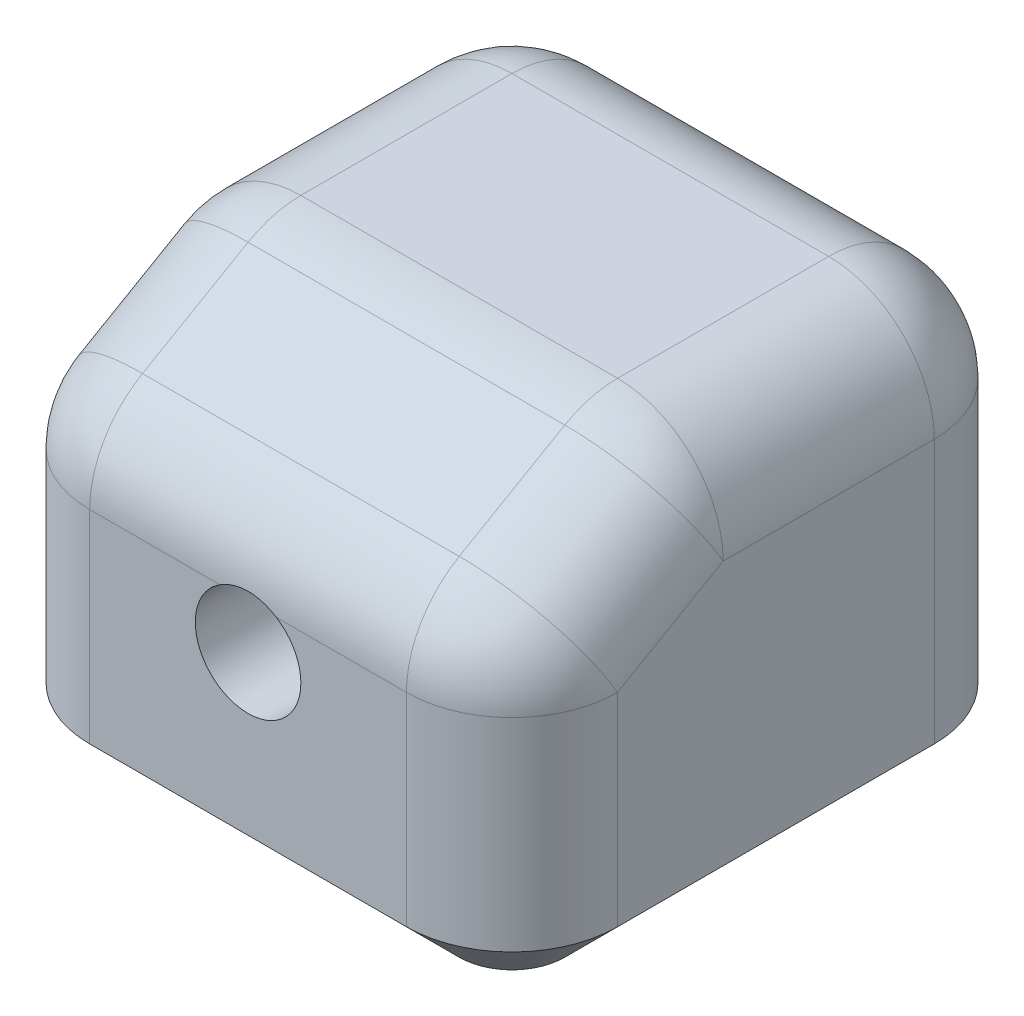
ISO-10303-21;
HEADER;
FILE_DESCRIPTION(('STEP AP214'),'2;1');
FILE_NAME('part.step','',(''),(''),'','','');
FILE_SCHEMA(('AUTOMOTIVE_DESIGN { 1 0 10303 214 1 1 1 1 }'));
ENDSEC;
DATA;
#1=APPLICATION_CONTEXT('core data for automotive mechanical design processes');
#2=APPLICATION_PROTOCOL_DEFINITION('international standard','automotive_design',2000,#1);
#3=PRODUCT_CONTEXT('',#1,'mechanical');
#4=PRODUCT('Part','Part','',(#3));
#5=PRODUCT_RELATED_PRODUCT_CATEGORY('part','',(#4));
#6=PRODUCT_DEFINITION_FORMATION('','',#4);
#7=PRODUCT_DEFINITION_CONTEXT('part definition',#1,'design');
#8=PRODUCT_DEFINITION('design','',#6,#7);
#9=PRODUCT_DEFINITION_SHAPE('','',#8);
#10=(LENGTH_UNIT() NAMED_UNIT(*) SI_UNIT(.MILLI.,.METRE.));
#11=(NAMED_UNIT(*) PLANE_ANGLE_UNIT() SI_UNIT($,.RADIAN.));
#12=(NAMED_UNIT(*) SI_UNIT($,.STERADIAN.) SOLID_ANGLE_UNIT());
#13=UNCERTAINTY_MEASURE_WITH_UNIT(LENGTH_MEASURE(1.E-05),#10,'distance_accuracy_value','');
#14=(GEOMETRIC_REPRESENTATION_CONTEXT(3) GLOBAL_UNCERTAINTY_ASSIGNED_CONTEXT((#13)) GLOBAL_UNIT_ASSIGNED_CONTEXT((#10,
#11,#12)) REPRESENTATION_CONTEXT('',''));
#15=CARTESIAN_POINT('',(0.,0.,0.));
#16=DIRECTION('',(0.,0.,1.));
#17=DIRECTION('',(1.,0.,0.));
#18=AXIS2_PLACEMENT_3D('',#15,#16,#17);
#19=CARTESIAN_POINT('',(-19.4081435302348,40.,-33.7655151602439));
#20=DIRECTION('',(1.,0.,0.));
#21=DIRECTION('',(0.,0.,-1.));
#22=AXIS2_PLACEMENT_3D('',#19,#20,#21);
#23=PLANE('',#22);
#24=DIRECTION('',(0.,-1.,0.));
#25=VECTOR('',#24,1.);
#26=CARTESIAN_POINT('',(-19.4081435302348,40.,6.23448483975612));
#27=LINE('',#26,#25);
#28=CARTESIAN_POINT('',(-19.4081435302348,5.00000000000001,6.23448483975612));
#29=VERTEX_POINT('',#28);
#30=CARTESIAN_POINT('',(-19.4081435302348,24.2264973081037,6.23448483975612));
#31=VERTEX_POINT('',#30);
#32=EDGE_CURVE('E478',#29,#31,#27,.F.);
#33=ORIENTED_EDGE('',*,*,#32,.T.);
#34=DIRECTION('',(0.,0.500000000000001,-0.866025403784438));
#35=VECTOR('',#34,1.);
#36=CARTESIAN_POINT('',(-19.4081435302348,31.3397459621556,-6.08602323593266));
#37=LINE('',#36,#35);
#38=CARTESIAN_POINT('',(-19.4081435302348,30.,-3.76551516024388));
#39=VERTEX_POINT('',#38);
#40=EDGE_CURVE('E400',#31,#39,#37,.T.);
#41=ORIENTED_EDGE('',*,*,#40,.T.);
#42=DIRECTION('',(0.,0.,1.));
#43=VECTOR('',#42,1.);
#44=CARTESIAN_POINT('',(-19.4081435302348,30.,-23.7655151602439));
#45=LINE('',#44,#43);
#46=CARTESIAN_POINT('',(-19.4081435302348,30.,-23.7655151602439));
#47=VERTEX_POINT('',#46);
#48=EDGE_CURVE('E415',#39,#47,#45,.F.);
#49=ORIENTED_EDGE('',*,*,#48,.T.);
#50=DIRECTION('',(0.,-1.,0.));
#51=VECTOR('',#50,1.);
#52=CARTESIAN_POINT('',(-19.4081435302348,40.,-23.7655151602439));
#53=LINE('',#52,#51);
#54=CARTESIAN_POINT('',(-19.4081435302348,5.00000000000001,-23.7655151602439));
#55=VERTEX_POINT('',#54);
#56=EDGE_CURVE('E199',#47,#55,#53,.T.);
#57=ORIENTED_EDGE('',*,*,#56,.T.);
#58=DIRECTION('',(0.,0.,1.));
#59=VECTOR('',#58,1.);
#60=CARTESIAN_POINT('',(-19.4081435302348,5.00000000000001,-33.7655151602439));
#61=LINE('',#60,#59);
#62=EDGE_CURVE('E224',#55,#29,#61,.T.);
#63=ORIENTED_EDGE('',*,*,#62,.T.);
#64=EDGE_LOOP('',(#33,#41,#49,#57,#63));
#65=FACE_BOUND('',#64,.T.);
#66=ADVANCED_FACE('F32',(#65),#23,.F.);
#67=CARTESIAN_POINT('',(-19.4081435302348,40.,16.2344848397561));
#68=DIRECTION('',(0.,0.,-1.));
#69=DIRECTION('',(-1.,0.,0.));
#70=AXIS2_PLACEMENT_3D('',#67,#68,#69);
#71=PLANE('',#70);
#72=DIRECTION('',(0.,-1.,0.));
#73=VECTOR('',#72,1.);
#74=CARTESIAN_POINT('',(20.5918564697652,40.,16.2344848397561));
#75=LINE('',#74,#73);
#76=CARTESIAN_POINT('',(20.5918564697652,5.00000000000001,16.2344848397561));
#77=VERTEX_POINT('',#76);
#78=CARTESIAN_POINT('',(20.5918564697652,24.2264973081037,16.2344848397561));
#79=VERTEX_POINT('',#78);
#80=EDGE_CURVE('E190',#77,#79,#75,.F.);
#81=ORIENTED_EDGE('',*,*,#80,.T.);
#82=DIRECTION('',(-1.,0.,0.));
#83=VECTOR('',#82,1.);
#84=CARTESIAN_POINT('',(-9.40814353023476,24.2264973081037,16.2344848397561));
#85=LINE('',#84,#83);
#86=CARTESIAN_POINT('',(8.26332058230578,24.2264973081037,16.2344848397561));
#87=VERTEX_POINT('',#86);
#88=EDGE_CURVE('E260',#79,#87,#85,.T.);
#89=ORIENTED_EDGE('',*,*,#88,.T.);
#90=CARTESIAN_POINT('',(5.59185646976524,20.,16.2344848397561));
#91=DIRECTION('',(0.,0.,1.));
#92=DIRECTION('',(1.,0.,0.));
#93=AXIS2_PLACEMENT_3D('',#90,#91,#92);
#94=CIRCLE('',#93,5.);
#95=CARTESIAN_POINT('',(2.9203923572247,24.2264973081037,16.2344848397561));
#96=VERTEX_POINT('',#95);
#97=EDGE_CURVE('E254',#96,#87,#94,.T.);
#98=ORIENTED_EDGE('',*,*,#97,.F.);
#99=DIRECTION('',(-1.,0.,0.));
#100=VECTOR('',#99,1.);
#101=CARTESIAN_POINT('',(-9.40814353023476,24.2264973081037,16.2344848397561));
#102=LINE('',#101,#100);
#103=CARTESIAN_POINT('',(-9.40814353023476,24.2264973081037,16.2344848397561));
#104=VERTEX_POINT('',#103);
#105=EDGE_CURVE('E258',#96,#104,#102,.T.);
#106=ORIENTED_EDGE('',*,*,#105,.T.);
#107=DIRECTION('',(0.,-1.,0.));
#108=VECTOR('',#107,1.);
#109=CARTESIAN_POINT('',(-9.40814353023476,40.,16.2344848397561));
#110=LINE('',#109,#108);
#111=CARTESIAN_POINT('',(-9.40814353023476,5.00000000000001,16.2344848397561));
#112=VERTEX_POINT('',#111);
#113=EDGE_CURVE('E205',#104,#112,#110,.T.);
#114=ORIENTED_EDGE('',*,*,#113,.T.);
#115=DIRECTION('',(1.,0.,0.));
#116=VECTOR('',#115,1.);
#117=CARTESIAN_POINT('',(-19.4081435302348,5.00000000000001,16.2344848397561));
#118=LINE('',#117,#116);
#119=EDGE_CURVE('E234',#112,#77,#118,.T.);
#120=ORIENTED_EDGE('',*,*,#119,.T.);
#121=EDGE_LOOP('',(#81,#89,#98,#106,#114,#120));
#122=FACE_BOUND('',#121,.T.);
#123=ADVANCED_FACE('F292',(#122),#71,.F.);
#124=CARTESIAN_POINT('',(30.5918564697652,40.,-33.7655151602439));
#125=DIRECTION('',(-1.,0.,0.));
#126=DIRECTION('',(0.,0.,1.));
#127=AXIS2_PLACEMENT_3D('',#124,#125,#126);
#128=PLANE('',#127);
#129=DIRECTION('',(0.,0.,-1.));
#130=VECTOR('',#129,1.);
#131=CARTESIAN_POINT('',(30.5918564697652,30.,-1.08602323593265));
#132=LINE('',#131,#130);
#133=CARTESIAN_POINT('',(30.5918564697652,30.,-23.7655151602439));
#134=VERTEX_POINT('',#133);
#135=CARTESIAN_POINT('',(30.5918564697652,30.,-3.76551516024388));
#136=VERTEX_POINT('',#135);
#137=EDGE_CURVE('E422',#134,#136,#132,.F.);
#138=ORIENTED_EDGE('',*,*,#137,.T.);
#139=DIRECTION('',(0.,-0.500000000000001,0.866025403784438));
#140=VECTOR('',#139,1.);
#141=CARTESIAN_POINT('',(30.5918564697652,27.1132486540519,1.23448483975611));
#142=LINE('',#141,#140);
#143=CARTESIAN_POINT('',(30.5918564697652,24.2264973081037,6.23448483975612));
#144=VERTEX_POINT('',#143);
#145=EDGE_CURVE('E424',#136,#144,#142,.T.);
#146=ORIENTED_EDGE('',*,*,#145,.T.);
#147=DIRECTION('',(0.,-1.,0.));
#148=VECTOR('',#147,1.);
#149=CARTESIAN_POINT('',(30.5918564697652,40.,6.23448483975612));
#150=LINE('',#149,#148);
#151=CARTESIAN_POINT('',(30.5918564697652,5.00000000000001,6.23448483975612));
#152=VERTEX_POINT('',#151);
#153=EDGE_CURVE('E195',#144,#152,#150,.T.);
#154=ORIENTED_EDGE('',*,*,#153,.T.);
#155=DIRECTION('',(0.,0.,-1.));
#156=VECTOR('',#155,1.);
#157=CARTESIAN_POINT('',(30.5918564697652,5.00000000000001,-33.7655151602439));
#158=LINE('',#157,#156);
#159=CARTESIAN_POINT('',(30.5918564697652,5.00000000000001,-23.7655151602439));
#160=VERTEX_POINT('',#159);
#161=EDGE_CURVE('E226',#152,#160,#158,.T.);
#162=ORIENTED_EDGE('',*,*,#161,.T.);
#163=DIRECTION('',(0.,-1.,0.));
#164=VECTOR('',#163,1.);
#165=CARTESIAN_POINT('',(30.5918564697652,40.,-23.7655151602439));
#166=LINE('',#165,#164);
#167=EDGE_CURVE('E197',#160,#134,#166,.F.);
#168=ORIENTED_EDGE('',*,*,#167,.T.);
#169=EDGE_LOOP('',(#138,#146,#154,#162,#168));
#170=FACE_BOUND('',#169,.T.);
#171=ADVANCED_FACE('F289',(#170),#128,.F.);
#172=CARTESIAN_POINT('',(-19.4081435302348,40.,-33.7655151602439));
#173=DIRECTION('',(0.,0.,1.));
#174=DIRECTION('',(1.,0.,0.));
#175=AXIS2_PLACEMENT_3D('',#172,#173,#174);
#176=PLANE('',#175);
#177=DIRECTION('',(0.,-1.,0.));
#178=VECTOR('',#177,1.);
#179=CARTESIAN_POINT('',(-9.40814353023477,40.,-33.7655151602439));
#180=LINE('',#179,#178);
#181=CARTESIAN_POINT('',(-9.40814353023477,5.00000000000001,-33.7655151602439));
#182=VERTEX_POINT('',#181);
#183=CARTESIAN_POINT('',(-9.40814353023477,30.,-33.7655151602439));
#184=VERTEX_POINT('',#183);
#185=EDGE_CURVE('E184',#182,#184,#180,.F.);
#186=ORIENTED_EDGE('',*,*,#185,.T.);
#187=DIRECTION('',(-1.,0.,0.));
#188=VECTOR('',#187,1.);
#189=CARTESIAN_POINT('',(20.5918564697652,30.,-33.7655151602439));
#190=LINE('',#189,#188);
#191=CARTESIAN_POINT('',(20.5918564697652,30.,-33.7655151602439));
#192=VERTEX_POINT('',#191);
#193=EDGE_CURVE('E11',#184,#192,#190,.F.);
#194=ORIENTED_EDGE('',*,*,#193,.T.);
#195=DIRECTION('',(0.,-1.,0.));
#196=VECTOR('',#195,1.);
#197=CARTESIAN_POINT('',(20.5918564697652,40.,-33.7655151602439));
#198=LINE('',#197,#196);
#199=CARTESIAN_POINT('',(20.5918564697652,5.00000000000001,-33.7655151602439));
#200=VERTEX_POINT('',#199);
#201=EDGE_CURVE('E187',#192,#200,#198,.T.);
#202=ORIENTED_EDGE('',*,*,#201,.T.);
#203=DIRECTION('',(-1.,0.,0.));
#204=VECTOR('',#203,1.);
#205=CARTESIAN_POINT('',(-19.4081435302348,5.00000000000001,-33.7655151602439));
#206=LINE('',#205,#204);
#207=EDGE_CURVE('E162',#200,#182,#206,.T.);
#208=ORIENTED_EDGE('',*,*,#207,.T.);
#209=EDGE_LOOP('',(#186,#194,#202,#208));
#210=FACE_BOUND('',#209,.T.);
#211=ADVANCED_FACE('F183',(#210),#176,.F.);
#212=CARTESIAN_POINT('',(-19.4081435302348,40.,16.2344848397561));
#213=DIRECTION('',(0.,1.,0.));
#214=DIRECTION('',(0.,0.,1.));
#215=AXIS2_PLACEMENT_3D('',#212,#213,#214);
#216=PLANE('',#215);
#217=DIRECTION('',(1.,0.,0.));
#218=VECTOR('',#217,1.);
#219=CARTESIAN_POINT('',(-19.4081435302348,40.,-3.76551516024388));
#220=LINE('',#219,#218);
#221=CARTESIAN_POINT('',(-9.40814353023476,40.,-3.76551516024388));
#222=VERTEX_POINT('',#221);
#223=CARTESIAN_POINT('',(20.5918564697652,40.,-3.76551516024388));
#224=VERTEX_POINT('',#223);
#225=EDGE_CURVE('E432',#222,#224,#220,.T.);
#226=ORIENTED_EDGE('',*,*,#225,.T.);
#227=DIRECTION('',(0.,0.,-1.));
#228=VECTOR('',#227,1.);
#229=CARTESIAN_POINT('',(20.5918564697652,40.,-23.7655151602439));
#230=LINE('',#229,#228);
#231=CARTESIAN_POINT('',(20.5918564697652,40.,-23.7655151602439));
#232=VERTEX_POINT('',#231);
#233=EDGE_CURVE('E41',#224,#232,#230,.T.);
#234=ORIENTED_EDGE('',*,*,#233,.T.);
#235=DIRECTION('',(-1.,0.,0.));
#236=VECTOR('',#235,1.);
#237=CARTESIAN_POINT('',(-9.40814353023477,40.,-23.7655151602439));
#238=LINE('',#237,#236);
#239=CARTESIAN_POINT('',(-9.40814353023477,40.,-23.7655151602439));
#240=VERTEX_POINT('',#239);
#241=EDGE_CURVE('E430',#232,#240,#238,.T.);
#242=ORIENTED_EDGE('',*,*,#241,.T.);
#243=DIRECTION('',(0.,0.,1.));
#244=VECTOR('',#243,1.);
#245=CARTESIAN_POINT('',(-9.40814353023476,40.,-1.08602323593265));
#246=LINE('',#245,#244);
#247=EDGE_CURVE('E428',#240,#222,#246,.T.);
#248=ORIENTED_EDGE('',*,*,#247,.T.);
#249=EDGE_LOOP('',(#226,#234,#242,#248));
#250=FACE_BOUND('',#249,.T.);
#251=ADVANCED_FACE('F281',(#250),#216,.T.);
#252=CARTESIAN_POINT('',(-19.4081435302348,0.,16.2344848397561));
#253=DIRECTION('',(0.,1.,0.));
#254=DIRECTION('',(0.,0.,1.));
#255=AXIS2_PLACEMENT_3D('',#252,#253,#254);
#256=PLANE('',#255);
#257=CARTESIAN_POINT('',(-9.40814353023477,0.,-23.7655151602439));
#258=DIRECTION('',(0.,1.,0.));
#259=DIRECTION('',(0.,0.,1.));
#260=AXIS2_PLACEMENT_3D('',#257,#258,#259);
#261=CIRCLE('',#260,4.99999999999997);
#262=CARTESIAN_POINT('',(-14.4081435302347,0.,-23.7655151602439));
#263=VERTEX_POINT('',#262);
#264=CARTESIAN_POINT('',(-9.40814353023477,0.,-28.7655151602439));
#265=VERTEX_POINT('',#264);
#266=EDGE_CURVE('E220',#263,#265,#261,.F.);
#267=ORIENTED_EDGE('',*,*,#266,.T.);
#268=DIRECTION('',(1.,0.,0.));
#269=VECTOR('',#268,1.);
#270=CARTESIAN_POINT('',(-19.4081435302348,0.,-28.7655151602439));
#271=LINE('',#270,#269);
#272=CARTESIAN_POINT('',(20.5918564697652,0.,-28.7655151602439));
#273=VERTEX_POINT('',#272);
#274=EDGE_CURVE('E164',#265,#273,#271,.T.);
#275=ORIENTED_EDGE('',*,*,#274,.T.);
#276=CARTESIAN_POINT('',(20.5918564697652,0.,-23.7655151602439));
#277=DIRECTION('',(0.,1.,0.));
#278=DIRECTION('',(0.,0.,1.));
#279=AXIS2_PLACEMENT_3D('',#276,#277,#278);
#280=CIRCLE('',#279,4.99999999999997);
#281=CARTESIAN_POINT('',(25.5918564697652,0.,-23.7655151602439));
#282=VERTEX_POINT('',#281);
#283=EDGE_CURVE('E218',#273,#282,#280,.F.);
#284=ORIENTED_EDGE('',*,*,#283,.T.);
#285=DIRECTION('',(0.,0.,1.));
#286=VECTOR('',#285,1.);
#287=CARTESIAN_POINT('',(25.5918564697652,0.,16.2344848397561));
#288=LINE('',#287,#286);
#289=CARTESIAN_POINT('',(25.5918564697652,0.,6.23448483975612));
#290=VERTEX_POINT('',#289);
#291=EDGE_CURVE('E214',#282,#290,#288,.T.);
#292=ORIENTED_EDGE('',*,*,#291,.T.);
#293=CARTESIAN_POINT('',(20.5918564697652,0.,6.23448483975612));
#294=DIRECTION('',(0.,1.,0.));
#295=DIRECTION('',(0.,0.,1.));
#296=AXIS2_PLACEMENT_3D('',#293,#294,#295);
#297=CIRCLE('',#296,4.99999999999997);
#298=CARTESIAN_POINT('',(20.5918564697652,0.,11.2344848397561));
#299=VERTEX_POINT('',#298);
#300=EDGE_CURVE('E210',#290,#299,#297,.F.);
#301=ORIENTED_EDGE('',*,*,#300,.T.);
#302=DIRECTION('',(-1.,0.,0.));
#303=VECTOR('',#302,1.);
#304=CARTESIAN_POINT('',(-19.4081435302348,0.,11.2344848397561));
#305=LINE('',#304,#303);
#306=CARTESIAN_POINT('',(-9.40814353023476,0.,11.2344848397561));
#307=VERTEX_POINT('',#306);
#308=EDGE_CURVE('E189',#299,#307,#305,.T.);
#309=ORIENTED_EDGE('',*,*,#308,.T.);
#310=CARTESIAN_POINT('',(-9.40814353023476,0.,6.23448483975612));
#311=DIRECTION('',(0.,1.,0.));
#312=DIRECTION('',(0.,0.,1.));
#313=AXIS2_PLACEMENT_3D('',#310,#311,#312);
#314=CIRCLE('',#313,4.99999999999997);
#315=CARTESIAN_POINT('',(-14.4081435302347,0.,6.23448483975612));
#316=VERTEX_POINT('',#315);
#317=EDGE_CURVE('E212',#307,#316,#314,.F.);
#318=ORIENTED_EDGE('',*,*,#317,.T.);
#319=DIRECTION('',(0.,0.,-1.));
#320=VECTOR('',#319,1.);
#321=CARTESIAN_POINT('',(-14.4081435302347,0.,16.2344848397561));
#322=LINE('',#321,#320);
#323=EDGE_CURVE('E216',#316,#263,#322,.T.);
#324=ORIENTED_EDGE('',*,*,#323,.T.);
#325=EDGE_LOOP('',(#267,#275,#284,#292,#301,#309,#318,#324));
#326=FACE_BOUND('',#325,.T.);
#327=ADVANCED_FACE('F279',(#326),#256,.F.);
#328=CARTESIAN_POINT('',(5.59185646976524,20.,6.23448483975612));
#329=DIRECTION('',(0.,0.,1.));
#330=DIRECTION('',(1.,0.,0.));
#331=AXIS2_PLACEMENT_3D('',#328,#329,#330);
#332=CYLINDRICAL_SURFACE('',#331,5.);
#333=CARTESIAN_POINT('',(5.59185646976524,20.,6.23448483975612));
#334=DIRECTION('',(0.,0.,1.));
#335=DIRECTION('',(1.,0.,0.));
#336=AXIS2_PLACEMENT_3D('',#333,#334,#335);
#337=CIRCLE('',#336,5.);
#338=CARTESIAN_POINT('',(10.5918564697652,20.,6.23448483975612));
#339=VERTEX_POINT('',#338);
#340=EDGE_CURVE('E479',#339,#339,#337,.T.);
#341=ORIENTED_EDGE('',*,*,#340,.F.);
#342=EDGE_LOOP('',(#341));
#343=FACE_BOUND('',#342,.T.);
#344=ORIENTED_EDGE('',*,*,#97,.T.);
#345=CARTESIAN_POINT('',(8.26332058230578,24.2264973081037,16.2344848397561));
#346=CARTESIAN_POINT('',(8.14451506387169,24.3016091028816,16.2344731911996));
#347=CARTESIAN_POINT('',(8.02253365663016,24.3716818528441,16.2336378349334));
#348=CARTESIAN_POINT('',(7.77312588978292,24.5013079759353,16.2309214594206));
#349=CARTESIAN_POINT('',(7.64569995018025,24.5608621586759,16.2290405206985));
#350=CARTESIAN_POINT('',(7.38639508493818,24.6689783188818,16.2248362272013));
#351=CARTESIAN_POINT('',(7.25451980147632,24.717549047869,16.222513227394));
#352=CARTESIAN_POINT('',(6.98715017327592,24.8034224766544,16.2179217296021));
#353=CARTESIAN_POINT('',(6.85165585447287,24.8407252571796,16.2156532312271));
#354=CARTESIAN_POINT('',(6.57797467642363,24.9038041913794,16.2115713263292));
#355=CARTESIAN_POINT('',(6.43978728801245,24.9295780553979,16.2097580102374));
#356=CARTESIAN_POINT('',(6.16167752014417,24.9694107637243,16.2068706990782));
#357=CARTESIAN_POINT('',(6.02175455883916,24.9834655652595,16.2057969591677));
#358=CARTESIAN_POINT('',(5.7412292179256,24.9997426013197,16.2045479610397));
#359=CARTESIAN_POINT('',(5.60062689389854,25.0019657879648,16.2043726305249));
#360=CARTESIAN_POINT('',(5.31973619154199,24.9945659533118,16.2049454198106));
#361=CARTESIAN_POINT('',(5.17944781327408,24.9849429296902,16.2056935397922));
#362=CARTESIAN_POINT('',(4.90031805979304,24.9539353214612,16.2080035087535));
#363=CARTESIAN_POINT('',(4.76147544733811,24.9325618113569,16.2095645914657));
#364=CARTESIAN_POINT('',(4.48613528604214,24.8782234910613,16.2132619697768));
#365=CARTESIAN_POINT('',(4.34963693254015,24.8452627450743,16.2153980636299));
#366=CARTESIAN_POINT('',(4.08001627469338,24.768017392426,16.2198866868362));
#367=CARTESIAN_POINT('',(3.94689118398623,24.7237424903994,16.2222390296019));
#368=CARTESIAN_POINT('',(3.6848786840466,24.6241824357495,16.2266981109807));
#369=CARTESIAN_POINT('',(3.55598931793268,24.5689024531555,16.2288049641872));
#370=CARTESIAN_POINT('',(3.34206334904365,24.4663041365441,16.2316973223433));
#371=CARTESIAN_POINT('',(3.25569671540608,24.4217406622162,16.2326899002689));
#372=CARTESIAN_POINT('',(3.08585399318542,24.3277430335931,16.2340820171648));
#373=CARTESIAN_POINT('',(3.00237299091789,24.2783177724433,16.2344826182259));
#374=CARTESIAN_POINT('',(2.9203923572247,24.2264973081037,16.2344848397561));
#375=B_SPLINE_CURVE_WITH_KNOTS('',3,(#345,#346,#347,#348,#349,#350,#351,#352,#353,#354,#355,
#356,#357,#358,#359,#360,#361,#362,#363,#364,#365,#366,#367,#368,#369,#370,#371,#372,#373,#374),
.UNSPECIFIED.,.F.,.F.,(4,2,2,2,2,2,2,2,2,2,2,2,2,2,4),(0.,0.42153522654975,0.843037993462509,
1.26420371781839,1.68536642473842,2.10661273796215,2.52800431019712,2.94936197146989,
3.37071971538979,3.79168102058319,4.21249482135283,4.63294887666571,5.053205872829,
5.34462202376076,5.63551469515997),.UNSPECIFIED.);
#376=EDGE_CURVE('E262',#87,#96,#375,.T.);
#377=ORIENTED_EDGE('',*,*,#376,.T.);
#378=EDGE_LOOP('',(#344,#377));
#379=FACE_BOUND('',#378,.T.);
#380=ADVANCED_FACE('F273',(#343,#379),#332,.F.);
#381=CARTESIAN_POINT('',(5.59185646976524,20.,6.23448483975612));
#382=DIRECTION('',(0.,0.,1.));
#383=DIRECTION('',(1.,0.,0.));
#384=AXIS2_PLACEMENT_3D('',#381,#382,#383);
#385=PLANE('',#384);
#386=ORIENTED_EDGE('',*,*,#340,.T.);
#387=EDGE_LOOP('',(#386));
#388=FACE_BOUND('',#387,.T.);
#389=ADVANCED_FACE('F278',(#388),#385,.T.);
#390=CARTESIAN_POINT('',(-9.40814353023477,40.,-23.7655151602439));
#391=DIRECTION('',(0.,-1.,0.));
#392=DIRECTION('',(0.,0.,-1.));
#393=AXIS2_PLACEMENT_3D('',#390,#391,#392);
#394=CYLINDRICAL_SURFACE('',#393,10.);
#395=ORIENTED_EDGE('',*,*,#56,.F.);
#396=CARTESIAN_POINT('',(-9.40814353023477,30.,-23.7655151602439));
#397=DIRECTION('',(0.,-1.,0.));
#398=DIRECTION('',(0.,0.,-1.));
#399=AXIS2_PLACEMENT_3D('',#396,#397,#398);
#400=CIRCLE('',#399,10.);
#401=EDGE_CURVE('E194',#47,#184,#400,.T.);
#402=ORIENTED_EDGE('',*,*,#401,.T.);
#403=ORIENTED_EDGE('',*,*,#185,.F.);
#404=CARTESIAN_POINT('',(-9.40814353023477,5.00000000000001,-23.7655151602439));
#405=DIRECTION('',(0.,1.,0.));
#406=DIRECTION('',(0.,0.,1.));
#407=AXIS2_PLACEMENT_3D('',#404,#405,#406);
#408=CIRCLE('',#407,10.);
#409=EDGE_CURVE('E171',#182,#55,#408,.T.);
#410=ORIENTED_EDGE('',*,*,#409,.T.);
#411=EDGE_LOOP('',(#395,#402,#403,#410));
#412=FACE_BOUND('',#411,.T.);
#413=ADVANCED_FACE('F192',(#412),#394,.T.);
#414=CARTESIAN_POINT('',(20.5918564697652,40.,-23.7655151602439));
#415=DIRECTION('',(0.,-1.,0.));
#416=DIRECTION('',(0.,0.,-1.));
#417=AXIS2_PLACEMENT_3D('',#414,#415,#416);
#418=CYLINDRICAL_SURFACE('',#417,10.);
#419=ORIENTED_EDGE('',*,*,#201,.F.);
#420=CARTESIAN_POINT('',(20.5918564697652,30.,-23.7655151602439));
#421=DIRECTION('',(0.,-1.,0.));
#422=DIRECTION('',(0.,0.,-1.));
#423=AXIS2_PLACEMENT_3D('',#420,#421,#422);
#424=CIRCLE('',#423,10.);
#425=EDGE_CURVE('E235',#192,#134,#424,.T.);
#426=ORIENTED_EDGE('',*,*,#425,.T.);
#427=ORIENTED_EDGE('',*,*,#167,.F.);
#428=CARTESIAN_POINT('',(20.5918564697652,5.00000000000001,-23.7655151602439));
#429=DIRECTION('',(0.,1.,0.));
#430=DIRECTION('',(0.,0.,1.));
#431=AXIS2_PLACEMENT_3D('',#428,#429,#430);
#432=CIRCLE('',#431,10.);
#433=EDGE_CURVE('E179',#160,#200,#432,.T.);
#434=ORIENTED_EDGE('',*,*,#433,.T.);
#435=EDGE_LOOP('',(#419,#426,#427,#434));
#436=FACE_BOUND('',#435,.T.);
#437=ADVANCED_FACE('F302',(#436),#418,.T.);
#438=CARTESIAN_POINT('',(20.5918564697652,40.,6.23448483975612));
#439=DIRECTION('',(0.,-1.,0.));
#440=DIRECTION('',(0.,0.,-1.));
#441=AXIS2_PLACEMENT_3D('',#438,#439,#440);
#442=CYLINDRICAL_SURFACE('',#441,10.);
#443=ORIENTED_EDGE('',*,*,#153,.F.);
#444=CARTESIAN_POINT('',(20.5918564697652,24.2264973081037,6.23448483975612));
#445=DIRECTION('',(0.,-1.,0.));
#446=DIRECTION('',(0.,0.,-1.));
#447=AXIS2_PLACEMENT_3D('',#444,#445,#446);
#448=CIRCLE('',#447,10.);
#449=EDGE_CURVE('E426',#144,#79,#448,.T.);
#450=ORIENTED_EDGE('',*,*,#449,.T.);
#451=ORIENTED_EDGE('',*,*,#80,.F.);
#452=CARTESIAN_POINT('',(20.5918564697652,5.00000000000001,6.23448483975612));
#453=DIRECTION('',(0.,1.,0.));
#454=DIRECTION('',(0.,0.,1.));
#455=AXIS2_PLACEMENT_3D('',#452,#453,#454);
#456=CIRCLE('',#455,10.);
#457=EDGE_CURVE('E231',#77,#152,#456,.T.);
#458=ORIENTED_EDGE('',*,*,#457,.T.);
#459=EDGE_LOOP('',(#443,#450,#451,#458));
#460=FACE_BOUND('',#459,.T.);
#461=ADVANCED_FACE('F305',(#460),#442,.T.);
#462=CARTESIAN_POINT('',(-9.40814353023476,40.,6.23448483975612));
#463=DIRECTION('',(0.,-1.,0.));
#464=DIRECTION('',(0.,0.,-1.));
#465=AXIS2_PLACEMENT_3D('',#462,#463,#464);
#466=CYLINDRICAL_SURFACE('',#465,10.);
#467=ORIENTED_EDGE('',*,*,#113,.F.);
#468=CARTESIAN_POINT('',(-9.40814353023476,24.2264973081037,6.23448483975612));
#469=DIRECTION('',(0.,-1.,0.));
#470=DIRECTION('',(0.,0.,-1.));
#471=AXIS2_PLACEMENT_3D('',#468,#469,#470);
#472=CIRCLE('',#471,10.);
#473=EDGE_CURVE('E406',#104,#31,#472,.T.);
#474=ORIENTED_EDGE('',*,*,#473,.T.);
#475=ORIENTED_EDGE('',*,*,#32,.F.);
#476=CARTESIAN_POINT('',(-9.40814353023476,5.00000000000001,6.23448483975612));
#477=DIRECTION('',(0.,1.,0.));
#478=DIRECTION('',(0.,0.,1.));
#479=AXIS2_PLACEMENT_3D('',#476,#477,#478);
#480=CIRCLE('',#479,10.);
#481=EDGE_CURVE('E228',#29,#112,#480,.T.);
#482=ORIENTED_EDGE('',*,*,#481,.T.);
#483=EDGE_LOOP('',(#467,#474,#475,#482));
#484=FACE_BOUND('',#483,.T.);
#485=ADVANCED_FACE('F309',(#484),#466,.T.);
#486=CARTESIAN_POINT('',(-19.4081435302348,40.,-1.08602323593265));
#487=DIRECTION('',(0.,0.866025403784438,0.500000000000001));
#488=DIRECTION('',(0.,-0.500000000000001,0.866025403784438));
#489=AXIS2_PLACEMENT_3D('',#486,#487,#488);
#490=PLANE('',#489);
#491=DIRECTION('',(0.,0.500000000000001,-0.866025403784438));
#492=VECTOR('',#491,1.);
#493=CARTESIAN_POINT('',(-9.40814353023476,35.7735026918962,6.23448483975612));
#494=LINE('',#493,#492);
#495=CARTESIAN_POINT('',(-9.40814353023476,38.6602540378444,1.23448483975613));
#496=VERTEX_POINT('',#495);
#497=CARTESIAN_POINT('',(-9.40814353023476,32.8867513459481,11.2344848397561));
#498=VERTEX_POINT('',#497);
#499=EDGE_CURVE('E398',#496,#498,#494,.F.);
#500=ORIENTED_EDGE('',*,*,#499,.T.);
#501=DIRECTION('',(-1.,0.,0.));
#502=VECTOR('',#501,1.);
#503=CARTESIAN_POINT('',(20.5918564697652,32.8867513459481,11.2344848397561));
#504=LINE('',#503,#502);
#505=CARTESIAN_POINT('',(20.5918564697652,32.8867513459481,11.2344848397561));
#506=VERTEX_POINT('',#505);
#507=EDGE_CURVE('E410',#498,#506,#504,.F.);
#508=ORIENTED_EDGE('',*,*,#507,.T.);
#509=DIRECTION('',(0.,-0.500000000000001,0.866025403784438));
#510=VECTOR('',#509,1.);
#511=CARTESIAN_POINT('',(20.5918564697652,40.,-1.08602323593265));
#512=LINE('',#511,#510);
#513=CARTESIAN_POINT('',(20.5918564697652,38.6602540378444,1.23448483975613));
#514=VERTEX_POINT('',#513);
#515=EDGE_CURVE('E417',#506,#514,#512,.F.);
#516=ORIENTED_EDGE('',*,*,#515,.T.);
#517=DIRECTION('',(1.,0.,0.));
#518=VECTOR('',#517,1.);
#519=CARTESIAN_POINT('',(-19.4081435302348,38.6602540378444,1.23448483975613));
#520=LINE('',#519,#518);
#521=EDGE_CURVE('E268',#514,#496,#520,.F.);
#522=ORIENTED_EDGE('',*,*,#521,.T.);
#523=EDGE_LOOP('',(#500,#508,#516,#522));
#524=FACE_BOUND('',#523,.T.);
#525=ADVANCED_FACE('F313',(#524),#490,.T.);
#526=CARTESIAN_POINT('',(-19.4081435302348,5.00000000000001,16.2344848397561));
#527=DIRECTION('',(0.,0.707106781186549,-0.707106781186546));
#528=DIRECTION('',(0.,0.707106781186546,0.707106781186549));
#529=AXIS2_PLACEMENT_3D('',#526,#527,#528);
#530=PLANE('',#529);
#531=DIRECTION('',(0.,0.707106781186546,0.707106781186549));
#532=VECTOR('',#531,1.);
#533=CARTESIAN_POINT('',(-9.40814353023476,0.,11.2344848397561));
#534=LINE('',#533,#532);
#535=EDGE_CURVE('E248',#307,#112,#534,.T.);
#536=ORIENTED_EDGE('',*,*,#535,.F.);
#537=ORIENTED_EDGE('',*,*,#308,.F.);
#538=DIRECTION('',(0.,-0.707106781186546,-0.707106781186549));
#539=VECTOR('',#538,1.);
#540=CARTESIAN_POINT('',(20.5918564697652,5.00000000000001,16.2344848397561));
#541=LINE('',#540,#539);
#542=EDGE_CURVE('E251',#77,#299,#541,.T.);
#543=ORIENTED_EDGE('',*,*,#542,.F.);
#544=ORIENTED_EDGE('',*,*,#119,.F.);
#545=EDGE_LOOP('',(#536,#537,#543,#544));
#546=FACE_BOUND('',#545,.T.);
#547=ADVANCED_FACE('F317',(#546),#530,.F.);
#548=CARTESIAN_POINT('',(20.5918564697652,0.,6.23448483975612));
#549=DIRECTION('',(0.,1.,0.));
#550=DIRECTION('',(0.,0.,1.));
#551=AXIS2_PLACEMENT_3D('',#548,#549,#550);
#552=CONICAL_SURFACE('',#551,4.99999999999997,0.78539816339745);
#553=ORIENTED_EDGE('',*,*,#542,.T.);
#554=ORIENTED_EDGE('',*,*,#300,.F.);
#555=DIRECTION('',(-0.707106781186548,-0.707106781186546,0.));
#556=VECTOR('',#555,1.);
#557=CARTESIAN_POINT('',(30.5918564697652,5.00000000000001,6.23448483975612));
#558=LINE('',#557,#556);
#559=EDGE_CURVE('E245',#152,#290,#558,.T.);
#560=ORIENTED_EDGE('',*,*,#559,.F.);
#561=ORIENTED_EDGE('',*,*,#457,.F.);
#562=EDGE_LOOP('',(#553,#554,#560,#561));
#563=FACE_BOUND('',#562,.T.);
#564=ADVANCED_FACE('F338',(#563),#552,.T.);
#565=CARTESIAN_POINT('',(-9.40814353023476,0.,6.23448483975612));
#566=DIRECTION('',(0.,1.,0.));
#567=DIRECTION('',(0.,0.,1.));
#568=AXIS2_PLACEMENT_3D('',#565,#566,#567);
#569=CONICAL_SURFACE('',#568,4.99999999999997,0.78539816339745);
#570=ORIENTED_EDGE('',*,*,#535,.T.);
#571=ORIENTED_EDGE('',*,*,#481,.F.);
#572=DIRECTION('',(-0.707106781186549,0.707106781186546,0.));
#573=VECTOR('',#572,1.);
#574=CARTESIAN_POINT('',(-14.4081435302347,0.,6.23448483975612));
#575=LINE('',#574,#573);
#576=EDGE_CURVE('E242',#316,#29,#575,.T.);
#577=ORIENTED_EDGE('',*,*,#576,.F.);
#578=ORIENTED_EDGE('',*,*,#317,.F.);
#579=EDGE_LOOP('',(#570,#571,#577,#578));
#580=FACE_BOUND('',#579,.T.);
#581=ADVANCED_FACE('F334',(#580),#569,.T.);
#582=CARTESIAN_POINT('',(30.5918564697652,5.00000000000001,-33.7655151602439));
#583=DIRECTION('',(-0.707106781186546,0.707106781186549,0.));
#584=DIRECTION('',(-0.707106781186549,-0.707106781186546,0.));
#585=AXIS2_PLACEMENT_3D('',#582,#583,#584);
#586=PLANE('',#585);
#587=ORIENTED_EDGE('',*,*,#559,.T.);
#588=ORIENTED_EDGE('',*,*,#291,.F.);
#589=DIRECTION('',(-0.707106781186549,-0.707106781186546,0.));
#590=VECTOR('',#589,1.);
#591=CARTESIAN_POINT('',(30.5918564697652,5.00000000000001,-23.7655151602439));
#592=LINE('',#591,#590);
#593=EDGE_CURVE('E239',#160,#282,#592,.T.);
#594=ORIENTED_EDGE('',*,*,#593,.F.);
#595=ORIENTED_EDGE('',*,*,#161,.F.);
#596=EDGE_LOOP('',(#587,#588,#594,#595));
#597=FACE_BOUND('',#596,.T.);
#598=ADVANCED_FACE('F330',(#597),#586,.F.);
#599=CARTESIAN_POINT('',(-19.4081435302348,5.00000000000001,-33.7655151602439));
#600=DIRECTION('',(0.707106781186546,0.707106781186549,0.));
#601=DIRECTION('',(-0.707106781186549,0.707106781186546,0.));
#602=AXIS2_PLACEMENT_3D('',#599,#600,#601);
#603=PLANE('',#602);
#604=ORIENTED_EDGE('',*,*,#576,.T.);
#605=ORIENTED_EDGE('',*,*,#62,.F.);
#606=DIRECTION('',(-0.707106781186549,0.707106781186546,0.));
#607=VECTOR('',#606,1.);
#608=CARTESIAN_POINT('',(-14.4081435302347,0.,-23.7655151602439));
#609=LINE('',#608,#607);
#610=EDGE_CURVE('E174',#263,#55,#609,.T.);
#611=ORIENTED_EDGE('',*,*,#610,.F.);
#612=ORIENTED_EDGE('',*,*,#323,.F.);
#613=EDGE_LOOP('',(#604,#605,#611,#612));
#614=FACE_BOUND('',#613,.T.);
#615=ADVANCED_FACE('F326',(#614),#603,.F.);
#616=CARTESIAN_POINT('',(20.5918564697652,0.,-23.7655151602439));
#617=DIRECTION('',(0.,1.,0.));
#618=DIRECTION('',(0.,0.,1.));
#619=AXIS2_PLACEMENT_3D('',#616,#617,#618);
#620=CONICAL_SURFACE('',#619,4.99999999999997,0.78539816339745);
#621=ORIENTED_EDGE('',*,*,#593,.T.);
#622=ORIENTED_EDGE('',*,*,#283,.F.);
#623=DIRECTION('',(0.,-0.707106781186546,0.707106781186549));
#624=VECTOR('',#623,1.);
#625=CARTESIAN_POINT('',(20.5918564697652,5.00000000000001,-33.7655151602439));
#626=LINE('',#625,#624);
#627=EDGE_CURVE('E167',#200,#273,#626,.T.);
#628=ORIENTED_EDGE('',*,*,#627,.F.);
#629=ORIENTED_EDGE('',*,*,#433,.F.);
#630=EDGE_LOOP('',(#621,#622,#628,#629));
#631=FACE_BOUND('',#630,.T.);
#632=ADVANCED_FACE('F323',(#631),#620,.T.);
#633=CARTESIAN_POINT('',(-9.40814353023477,0.,-23.7655151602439));
#634=DIRECTION('',(0.,1.,0.));
#635=DIRECTION('',(0.,0.,1.));
#636=AXIS2_PLACEMENT_3D('',#633,#634,#635);
#637=CONICAL_SURFACE('',#636,4.99999999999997,0.78539816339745);
#638=ORIENTED_EDGE('',*,*,#610,.T.);
#639=ORIENTED_EDGE('',*,*,#409,.F.);
#640=DIRECTION('',(0.,0.707106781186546,-0.707106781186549));
#641=VECTOR('',#640,1.);
#642=CARTESIAN_POINT('',(-9.40814353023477,0.,-28.7655151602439));
#643=LINE('',#642,#641);
#644=EDGE_CURVE('E158',#265,#182,#643,.T.);
#645=ORIENTED_EDGE('',*,*,#644,.F.);
#646=ORIENTED_EDGE('',*,*,#266,.F.);
#647=EDGE_LOOP('',(#638,#639,#645,#646));
#648=FACE_BOUND('',#647,.T.);
#649=ADVANCED_FACE('F172',(#648),#637,.T.);
#650=CARTESIAN_POINT('',(-19.4081435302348,5.00000000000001,-33.7655151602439));
#651=DIRECTION('',(0.,0.707106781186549,0.707106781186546));
#652=DIRECTION('',(0.,-0.707106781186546,0.707106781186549));
#653=AXIS2_PLACEMENT_3D('',#650,#651,#652);
#654=PLANE('',#653);
#655=ORIENTED_EDGE('',*,*,#627,.T.);
#656=ORIENTED_EDGE('',*,*,#274,.F.);
#657=ORIENTED_EDGE('',*,*,#644,.T.);
#658=ORIENTED_EDGE('',*,*,#207,.F.);
#659=EDGE_LOOP('',(#655,#656,#657,#658));
#660=FACE_BOUND('',#659,.T.);
#661=ADVANCED_FACE('F160',(#660),#654,.F.);
#662=CARTESIAN_POINT('',(-9.40814353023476,24.2264973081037,6.23448483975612));
#663=DIRECTION('',(0.,0.,1.));
#664=DIRECTION('',(1.,0.,0.));
#665=AXIS2_PLACEMENT_3D('',#662,#663,#664);
#666=SPHERICAL_SURFACE('',#665,10.);
#667=CARTESIAN_POINT('',(-9.40814353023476,24.2264973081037,6.23448483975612));
#668=DIRECTION('',(0.,0.500000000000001,-0.866025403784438));
#669=DIRECTION('',(0.,0.866025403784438,0.500000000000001));
#670=AXIS2_PLACEMENT_3D('',#667,#668,#669);
#671=CIRCLE('',#670,10.);
#672=EDGE_CURVE('E395',#31,#498,#671,.T.);
#673=ORIENTED_EDGE('',*,*,#672,.F.);
#674=ORIENTED_EDGE('',*,*,#473,.F.);
#675=CARTESIAN_POINT('',(-9.40814353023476,24.2264973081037,6.23448483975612));
#676=DIRECTION('',(1.,0.,0.));
#677=DIRECTION('',(0.,0.,-1.));
#678=AXIS2_PLACEMENT_3D('',#675,#676,#677);
#679=CIRCLE('',#678,10.);
#680=EDGE_CURVE('E36',#498,#104,#679,.T.);
#681=ORIENTED_EDGE('',*,*,#680,.F.);
#682=EDGE_LOOP('',(#673,#674,#681));
#683=FACE_BOUND('',#682,.T.);
#684=ADVANCED_FACE('F34',(#683),#666,.T.);
#685=CARTESIAN_POINT('',(-19.4081435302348,24.2264973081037,6.23448483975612));
#686=DIRECTION('',(1.,0.,0.));
#687=DIRECTION('',(0.,0.,-1.));
#688=AXIS2_PLACEMENT_3D('',#685,#686,#687);
#689=CYLINDRICAL_SURFACE('',#688,10.);
#690=ORIENTED_EDGE('',*,*,#376,.F.);
#691=ORIENTED_EDGE('',*,*,#88,.F.);
#692=CARTESIAN_POINT('',(20.5918564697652,24.2264973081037,6.23448483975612));
#693=DIRECTION('',(1.,0.,0.));
#694=DIRECTION('',(0.,0.,-1.));
#695=AXIS2_PLACEMENT_3D('',#692,#693,#694);
#696=CIRCLE('',#695,10.);
#697=EDGE_CURVE('E403',#506,#79,#696,.T.);
#698=ORIENTED_EDGE('',*,*,#697,.F.);
#699=ORIENTED_EDGE('',*,*,#507,.F.);
#700=ORIENTED_EDGE('',*,*,#680,.T.);
#701=ORIENTED_EDGE('',*,*,#105,.F.);
#702=EDGE_LOOP('',(#690,#691,#698,#699,#700,#701));
#703=FACE_BOUND('',#702,.T.);
#704=ADVANCED_FACE('F270',(#703),#689,.T.);
#705=CARTESIAN_POINT('',(-9.40814353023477,45.4903810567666,-30.5956421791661));
#706=DIRECTION('',(0.,-0.500000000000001,0.866025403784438));
#707=DIRECTION('',(0.,-0.866025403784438,-0.500000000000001));
#708=AXIS2_PLACEMENT_3D('',#705,#706,#707);
#709=CYLINDRICAL_SURFACE('',#708,10.);
#710=ORIENTED_EDGE('',*,*,#672,.T.);
#711=ORIENTED_EDGE('',*,*,#499,.F.);
#712=CARTESIAN_POINT('',(-9.40814353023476,30.,-3.76551516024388));
#713=DIRECTION('',(0.,0.500000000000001,-0.866025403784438));
#714=DIRECTION('',(0.,0.866025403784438,0.500000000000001));
#715=AXIS2_PLACEMENT_3D('',#712,#713,#714);
#716=CIRCLE('',#715,10.);
#717=EDGE_CURVE('E463',#39,#496,#716,.T.);
#718=ORIENTED_EDGE('',*,*,#717,.F.);
#719=ORIENTED_EDGE('',*,*,#40,.F.);
#720=EDGE_LOOP('',(#710,#711,#718,#719));
#721=FACE_BOUND('',#720,.T.);
#722=ADVANCED_FACE('F383',(#721),#709,.T.);
#723=CARTESIAN_POINT('',(20.5918564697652,24.2264973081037,6.23448483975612));
#724=DIRECTION('',(0.,0.,1.));
#725=DIRECTION('',(1.,0.,0.));
#726=AXIS2_PLACEMENT_3D('',#723,#724,#725);
#727=SPHERICAL_SURFACE('',#726,10.);
#728=ORIENTED_EDGE('',*,*,#697,.T.);
#729=ORIENTED_EDGE('',*,*,#449,.F.);
#730=CARTESIAN_POINT('',(20.5918564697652,24.2264973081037,6.23448483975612));
#731=DIRECTION('',(0.,0.500000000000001,-0.866025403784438));
#732=DIRECTION('',(0.,0.866025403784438,0.500000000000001));
#733=AXIS2_PLACEMENT_3D('',#730,#731,#732);
#734=CIRCLE('',#733,10.);
#735=EDGE_CURVE('E460',#506,#144,#734,.T.);
#736=ORIENTED_EDGE('',*,*,#735,.F.);
#737=EDGE_LOOP('',(#728,#729,#736));
#738=FACE_BOUND('',#737,.T.);
#739=ADVANCED_FACE('F380',(#738),#727,.T.);
#740=CARTESIAN_POINT('',(-9.40814353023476,30.,-3.76551516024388));
#741=DIRECTION('',(0.,0.,1.));
#742=DIRECTION('',(1.,0.,0.));
#743=AXIS2_PLACEMENT_3D('',#740,#741,#742);
#744=SPHERICAL_SURFACE('',#743,10.);
#745=CARTESIAN_POINT('',(-9.40814353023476,30.,-3.76551516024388));
#746=DIRECTION('',(0.,0.,1.));
#747=DIRECTION('',(1.,0.,0.));
#748=AXIS2_PLACEMENT_3D('',#745,#746,#747);
#749=CIRCLE('',#748,10.);
#750=EDGE_CURVE('E454',#39,#222,#749,.F.);
#751=ORIENTED_EDGE('',*,*,#750,.F.);
#752=ORIENTED_EDGE('',*,*,#717,.T.);
#753=CARTESIAN_POINT('',(-9.40814353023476,30.,-3.76551516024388));
#754=DIRECTION('',(-1.,0.,0.));
#755=DIRECTION('',(0.,0.,1.));
#756=AXIS2_PLACEMENT_3D('',#753,#754,#755);
#757=CIRCLE('',#756,10.);
#758=EDGE_CURVE('E457',#222,#496,#757,.F.);
#759=ORIENTED_EDGE('',*,*,#758,.F.);
#760=EDGE_LOOP('',(#751,#752,#759));
#761=FACE_BOUND('',#760,.T.);
#762=ADVANCED_FACE('F376',(#761),#744,.T.);
#763=CARTESIAN_POINT('',(20.5918564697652,45.4903810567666,-30.5956421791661));
#764=DIRECTION('',(0.,0.500000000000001,-0.866025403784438));
#765=DIRECTION('',(0.,0.866025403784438,0.500000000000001));
#766=AXIS2_PLACEMENT_3D('',#763,#764,#765);
#767=CYLINDRICAL_SURFACE('',#766,10.);
#768=ORIENTED_EDGE('',*,*,#735,.T.);
#769=ORIENTED_EDGE('',*,*,#145,.F.);
#770=CARTESIAN_POINT('',(20.5918564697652,30.,-3.76551516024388));
#771=DIRECTION('',(0.,0.500000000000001,-0.866025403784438));
#772=DIRECTION('',(0.,0.866025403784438,0.500000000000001));
#773=AXIS2_PLACEMENT_3D('',#770,#771,#772);
#774=CIRCLE('',#773,10.);
#775=EDGE_CURVE('E451',#514,#136,#774,.T.);
#776=ORIENTED_EDGE('',*,*,#775,.F.);
#777=ORIENTED_EDGE('',*,*,#515,.F.);
#778=EDGE_LOOP('',(#768,#769,#776,#777));
#779=FACE_BOUND('',#778,.T.);
#780=ADVANCED_FACE('F372',(#779),#767,.T.);
#781=CARTESIAN_POINT('',(-19.4081435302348,30.,-3.76551516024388));
#782=DIRECTION('',(1.,0.,0.));
#783=DIRECTION('',(0.,0.,-1.));
#784=AXIS2_PLACEMENT_3D('',#781,#782,#783);
#785=CYLINDRICAL_SURFACE('',#784,10.);
#786=ORIENTED_EDGE('',*,*,#758,.T.);
#787=ORIENTED_EDGE('',*,*,#521,.F.);
#788=CARTESIAN_POINT('',(20.5918564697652,30.,-3.76551516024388));
#789=DIRECTION('',(1.,0.,0.));
#790=DIRECTION('',(0.,0.,-1.));
#791=AXIS2_PLACEMENT_3D('',#788,#789,#790);
#792=CIRCLE('',#791,10.);
#793=EDGE_CURVE('E448',#224,#514,#792,.T.);
#794=ORIENTED_EDGE('',*,*,#793,.F.);
#795=ORIENTED_EDGE('',*,*,#225,.F.);
#796=EDGE_LOOP('',(#786,#787,#794,#795));
#797=FACE_BOUND('',#796,.T.);
#798=ADVANCED_FACE('F368',(#797),#785,.T.);
#799=CARTESIAN_POINT('',(-9.40814353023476,30.,16.2344848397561));
#800=DIRECTION('',(0.,0.,-1.));
#801=DIRECTION('',(-1.,0.,0.));
#802=AXIS2_PLACEMENT_3D('',#799,#800,#801);
#803=CYLINDRICAL_SURFACE('',#802,10.);
#804=ORIENTED_EDGE('',*,*,#750,.T.);
#805=ORIENTED_EDGE('',*,*,#247,.F.);
#806=CARTESIAN_POINT('',(-9.40814353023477,30.,-23.7655151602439));
#807=DIRECTION('',(0.,0.,-1.));
#808=DIRECTION('',(-1.,0.,0.));
#809=AXIS2_PLACEMENT_3D('',#806,#807,#808);
#810=CIRCLE('',#809,10.);
#811=EDGE_CURVE('E445',#47,#240,#810,.T.);
#812=ORIENTED_EDGE('',*,*,#811,.F.);
#813=ORIENTED_EDGE('',*,*,#48,.F.);
#814=EDGE_LOOP('',(#804,#805,#812,#813));
#815=FACE_BOUND('',#814,.T.);
#816=ADVANCED_FACE('F364',(#815),#803,.T.);
#817=CARTESIAN_POINT('',(20.5918564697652,30.,-3.76551516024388));
#818=DIRECTION('',(0.,0.,1.));
#819=DIRECTION('',(1.,0.,0.));
#820=AXIS2_PLACEMENT_3D('',#817,#818,#819);
#821=SPHERICAL_SURFACE('',#820,10.);
#822=ORIENTED_EDGE('',*,*,#793,.T.);
#823=ORIENTED_EDGE('',*,*,#775,.T.);
#824=CARTESIAN_POINT('',(20.5918564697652,30.,-3.76551516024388));
#825=DIRECTION('',(0.,0.,1.));
#826=DIRECTION('',(0.,-1.,0.));
#827=AXIS2_PLACEMENT_3D('',#824,#825,#826);
#828=CIRCLE('',#827,10.);
#829=EDGE_CURVE('E443',#224,#136,#828,.F.);
#830=ORIENTED_EDGE('',*,*,#829,.F.);
#831=EDGE_LOOP('',(#822,#823,#830));
#832=FACE_BOUND('',#831,.T.);
#833=ADVANCED_FACE('F360',(#832),#821,.T.);
#834=CARTESIAN_POINT('',(-9.40814353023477,30.,-23.7655151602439));
#835=DIRECTION('',(0.,0.,1.));
#836=DIRECTION('',(1.,0.,0.));
#837=AXIS2_PLACEMENT_3D('',#834,#835,#836);
#838=SPHERICAL_SURFACE('',#837,10.);
#839=ORIENTED_EDGE('',*,*,#401,.F.);
#840=ORIENTED_EDGE('',*,*,#811,.T.);
#841=CARTESIAN_POINT('',(-9.40814353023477,30.,-23.7655151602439));
#842=DIRECTION('',(1.,0.,0.));
#843=DIRECTION('',(0.,0.,-1.));
#844=AXIS2_PLACEMENT_3D('',#841,#842,#843);
#845=CIRCLE('',#844,10.);
#846=EDGE_CURVE('E440',#184,#240,#845,.T.);
#847=ORIENTED_EDGE('',*,*,#846,.F.);
#848=EDGE_LOOP('',(#839,#840,#847));
#849=FACE_BOUND('',#848,.T.);
#850=ADVANCED_FACE('F357',(#849),#838,.T.);
#851=CARTESIAN_POINT('',(20.5918564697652,30.,16.2344848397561));
#852=DIRECTION('',(0.,0.,1.));
#853=DIRECTION('',(1.,0.,0.));
#854=AXIS2_PLACEMENT_3D('',#851,#852,#853);
#855=CYLINDRICAL_SURFACE('',#854,10.);
#856=ORIENTED_EDGE('',*,*,#829,.T.);
#857=ORIENTED_EDGE('',*,*,#137,.F.);
#858=CARTESIAN_POINT('',(20.5918564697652,30.,-23.7655151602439));
#859=DIRECTION('',(0.,0.,-1.));
#860=DIRECTION('',(-1.,0.,0.));
#861=AXIS2_PLACEMENT_3D('',#858,#859,#860);
#862=CIRCLE('',#861,10.);
#863=EDGE_CURVE('E438',#232,#134,#862,.T.);
#864=ORIENTED_EDGE('',*,*,#863,.F.);
#865=ORIENTED_EDGE('',*,*,#233,.F.);
#866=EDGE_LOOP('',(#856,#857,#864,#865));
#867=FACE_BOUND('',#866,.T.);
#868=ADVANCED_FACE('F353',(#867),#855,.T.);
#869=CARTESIAN_POINT('',(-19.4081435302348,30.,-23.7655151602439));
#870=DIRECTION('',(1.,0.,0.));
#871=DIRECTION('',(0.,0.,-1.));
#872=AXIS2_PLACEMENT_3D('',#869,#870,#871);
#873=CYLINDRICAL_SURFACE('',#872,10.);
#874=ORIENTED_EDGE('',*,*,#846,.T.);
#875=ORIENTED_EDGE('',*,*,#241,.F.);
#876=CARTESIAN_POINT('',(20.5918564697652,30.,-23.7655151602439));
#877=DIRECTION('',(1.,0.,0.));
#878=DIRECTION('',(0.,0.,-1.));
#879=AXIS2_PLACEMENT_3D('',#876,#877,#878);
#880=CIRCLE('',#879,10.);
#881=EDGE_CURVE('E435',#192,#232,#880,.T.);
#882=ORIENTED_EDGE('',*,*,#881,.F.);
#883=ORIENTED_EDGE('',*,*,#193,.F.);
#884=EDGE_LOOP('',(#874,#875,#882,#883));
#885=FACE_BOUND('',#884,.T.);
#886=ADVANCED_FACE('F349',(#885),#873,.T.);
#887=CARTESIAN_POINT('',(20.5918564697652,30.,-23.7655151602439));
#888=DIRECTION('',(0.,0.,1.));
#889=DIRECTION('',(1.,0.,0.));
#890=AXIS2_PLACEMENT_3D('',#887,#888,#889);
#891=SPHERICAL_SURFACE('',#890,10.);
#892=ORIENTED_EDGE('',*,*,#863,.T.);
#893=ORIENTED_EDGE('',*,*,#425,.F.);
#894=ORIENTED_EDGE('',*,*,#881,.T.);
#895=EDGE_LOOP('',(#892,#893,#894));
#896=FACE_BOUND('',#895,.T.);
#897=ADVANCED_FACE('F346',(#896),#891,.T.);
#898=CLOSED_SHELL('',(#66,#123,#171,#211,#251,#327,#380,#389,#413,#437,#461,#485,#525,#547,#564,
#581,#598,#615,#632,#649,#661,#684,#704,#722,#739,#762,#780,#798,#816,#833,#850,#868,#886,#897));
#899=MANIFOLD_SOLID_BREP('B2',#898);
#900=ADVANCED_BREP_SHAPE_REPRESENTATION('',(#18,#899),#14);
#901=SHAPE_DEFINITION_REPRESENTATION(#9,#900);
ENDSEC;
END-ISO-10303-21;
